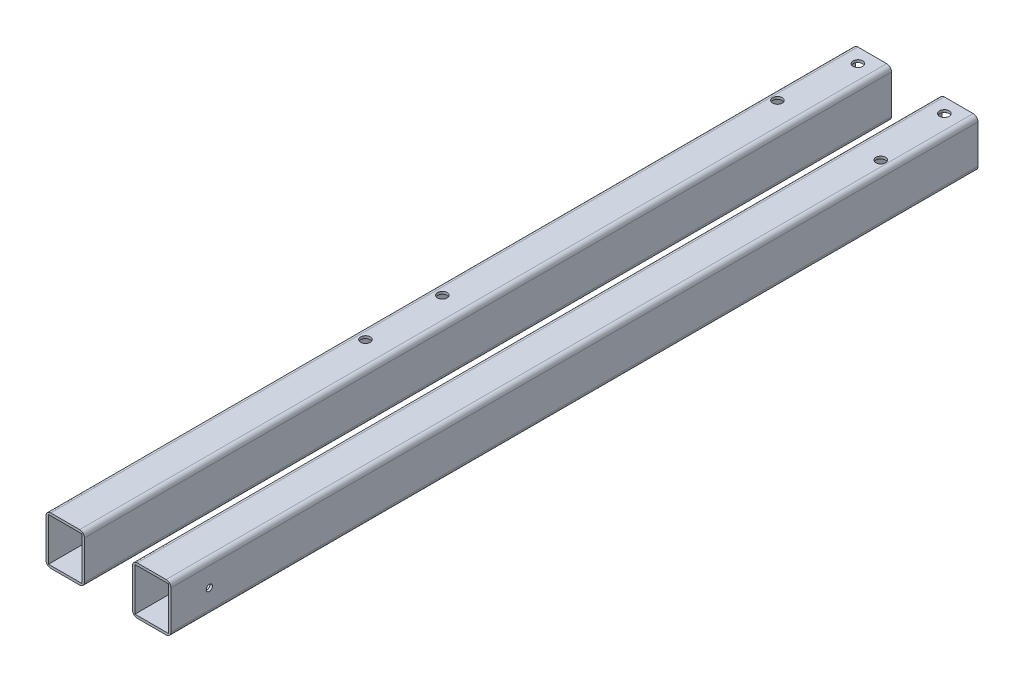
ISO-10303-21;
HEADER;
FILE_DESCRIPTION(('STEP AP214'),'2;1');
FILE_NAME('part.step','',(''),(''),'','','');
FILE_SCHEMA(('AUTOMOTIVE_DESIGN { 1 0 10303 214 1 1 1 1 }'));
ENDSEC;
DATA;
#1=APPLICATION_CONTEXT('core data for automotive mechanical design processes');
#2=APPLICATION_PROTOCOL_DEFINITION('international standard','automotive_design',2000,#1);
#3=PRODUCT_CONTEXT('',#1,'mechanical');
#4=PRODUCT('Part','Part','',(#3));
#5=PRODUCT_RELATED_PRODUCT_CATEGORY('part','',(#4));
#6=PRODUCT_DEFINITION_FORMATION('','',#4);
#7=PRODUCT_DEFINITION_CONTEXT('part definition',#1,'design');
#8=PRODUCT_DEFINITION('design','',#6,#7);
#9=PRODUCT_DEFINITION_SHAPE('','',#8);
#10=(LENGTH_UNIT() NAMED_UNIT(*) SI_UNIT(.MILLI.,.METRE.));
#11=(NAMED_UNIT(*) PLANE_ANGLE_UNIT() SI_UNIT($,.RADIAN.));
#12=(NAMED_UNIT(*) SI_UNIT($,.STERADIAN.) SOLID_ANGLE_UNIT());
#13=UNCERTAINTY_MEASURE_WITH_UNIT(LENGTH_MEASURE(1.E-05),#10,'distance_accuracy_value','');
#14=(GEOMETRIC_REPRESENTATION_CONTEXT(3) GLOBAL_UNCERTAINTY_ASSIGNED_CONTEXT((#13)) GLOBAL_UNIT_ASSIGNED_CONTEXT((#10,
#11,#12)) REPRESENTATION_CONTEXT('',''));
#15=CARTESIAN_POINT('',(0.,0.,0.));
#16=DIRECTION('',(0.,0.,1.));
#17=DIRECTION('',(1.,0.,0.));
#18=AXIS2_PLACEMENT_3D('',#15,#16,#17);
#19=CARTESIAN_POINT('',(41.275,15.875,533.4));
#20=DIRECTION('',(-1.,0.,0.));
#21=DIRECTION('',(0.,-1.,0.));
#22=AXIS2_PLACEMENT_3D('',#19,#20,#21);
#23=PLANE('',#22);
#24=DIRECTION('',(0.,1.,0.));
#25=VECTOR('',#24,1.);
#26=CARTESIAN_POINT('',(41.275,15.875,533.4));
#27=LINE('',#26,#25);
#28=CARTESIAN_POINT('',(41.275,-12.7,533.4));
#29=VERTEX_POINT('',#28);
#30=CARTESIAN_POINT('',(41.275,12.7,533.4));
#31=VERTEX_POINT('',#30);
#32=EDGE_CURVE('E227',#29,#31,#27,.T.);
#33=ORIENTED_EDGE('',*,*,#32,.F.);
#34=DIRECTION('',(0.,0.,-1.));
#35=VECTOR('',#34,1.);
#36=CARTESIAN_POINT('',(41.275,-12.7,533.4));
#37=LINE('',#36,#35);
#38=CARTESIAN_POINT('',(41.275,-12.7,0.));
#39=VERTEX_POINT('',#38);
#40=EDGE_CURVE('E274',#29,#39,#37,.T.);
#41=ORIENTED_EDGE('',*,*,#40,.T.);
#42=DIRECTION('',(0.,1.,0.));
#43=VECTOR('',#42,1.);
#44=CARTESIAN_POINT('',(41.275,15.875,0.));
#45=LINE('',#44,#43);
#46=CARTESIAN_POINT('',(41.275,12.7,0.));
#47=VERTEX_POINT('',#46);
#48=EDGE_CURVE('E201',#39,#47,#45,.T.);
#49=ORIENTED_EDGE('',*,*,#48,.T.);
#50=DIRECTION('',(0.,0.,-1.));
#51=VECTOR('',#50,1.);
#52=CARTESIAN_POINT('',(41.275,12.7,533.4));
#53=LINE('',#52,#51);
#54=EDGE_CURVE('E272',#47,#31,#53,.F.);
#55=ORIENTED_EDGE('',*,*,#54,.T.);
#56=EDGE_LOOP('',(#33,#41,#49,#55));
#57=FACE_BOUND('',#56,.T.);
#58=CARTESIAN_POINT('',(41.275,0.,508.));
#59=DIRECTION('',(-1.,0.,0.));
#60=DIRECTION('',(0.,-1.,0.));
#61=AXIS2_PLACEMENT_3D('',#58,#59,#60);
#62=CIRCLE('',#61,2.05739999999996);
#63=CARTESIAN_POINT('',(41.275,-2.05739999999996,508.));
#64=VERTEX_POINT('',#63);
#65=EDGE_CURVE('E216',#64,#64,#62,.F.);
#66=ORIENTED_EDGE('',*,*,#65,.F.);
#67=EDGE_LOOP('',(#66));
#68=FACE_BOUND('',#67,.T.);
#69=ADVANCED_FACE('F90',(#57,#68),#23,.F.);
#70=CARTESIAN_POINT('',(39.624,15.875,533.4));
#71=DIRECTION('',(-1.,0.,0.));
#72=DIRECTION('',(0.,-1.,0.));
#73=AXIS2_PLACEMENT_3D('',#70,#71,#72);
#74=PLANE('',#73);
#75=DIRECTION('',(0.,1.,0.));
#76=VECTOR('',#75,1.);
#77=CARTESIAN_POINT('',(39.624,15.875,0.));
#78=LINE('',#77,#76);
#79=CARTESIAN_POINT('',(39.624,-14.224,0.));
#80=VERTEX_POINT('',#79);
#81=CARTESIAN_POINT('',(39.624,14.224,0.));
#82=VERTEX_POINT('',#81);
#83=EDGE_CURVE('E214',#80,#82,#78,.T.);
#84=ORIENTED_EDGE('',*,*,#83,.F.);
#85=DIRECTION('',(0.,0.,-1.));
#86=VECTOR('',#85,1.);
#87=CARTESIAN_POINT('',(39.624,-14.224,533.4));
#88=LINE('',#87,#86);
#89=CARTESIAN_POINT('',(39.624,-14.224,533.4));
#90=VERTEX_POINT('',#89);
#91=EDGE_CURVE('E189',#90,#80,#88,.T.);
#92=ORIENTED_EDGE('',*,*,#91,.F.);
#93=DIRECTION('',(0.,1.,0.));
#94=VECTOR('',#93,1.);
#95=CARTESIAN_POINT('',(39.624,15.875,533.4));
#96=LINE('',#95,#94);
#97=CARTESIAN_POINT('',(39.624,14.224,533.4));
#98=VERTEX_POINT('',#97);
#99=EDGE_CURVE('E182',#90,#98,#96,.T.);
#100=ORIENTED_EDGE('',*,*,#99,.T.);
#101=DIRECTION('',(0.,0.,-1.));
#102=VECTOR('',#101,1.);
#103=CARTESIAN_POINT('',(39.624,14.224,533.4));
#104=LINE('',#103,#102);
#105=EDGE_CURVE('E186',#98,#82,#104,.T.);
#106=ORIENTED_EDGE('',*,*,#105,.T.);
#107=EDGE_LOOP('',(#84,#92,#100,#106));
#108=FACE_BOUND('',#107,.T.);
#109=CARTESIAN_POINT('',(39.624,0.,508.));
#110=DIRECTION('',(-1.,0.,0.));
#111=DIRECTION('',(0.,-1.,0.));
#112=AXIS2_PLACEMENT_3D('',#109,#110,#111);
#113=CIRCLE('',#112,2.05739999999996);
#114=CARTESIAN_POINT('',(39.624,-2.05739999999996,508.));
#115=VERTEX_POINT('',#114);
#116=EDGE_CURVE('E279',#115,#115,#113,.F.);
#117=ORIENTED_EDGE('',*,*,#116,.T.);
#118=EDGE_LOOP('',(#117));
#119=FACE_BOUND('',#118,.T.);
#120=ADVANCED_FACE('F184',(#108,#119),#74,.T.);
#121=CARTESIAN_POINT('',(0.,0.,533.4));
#122=DIRECTION('',(0.,0.,1.));
#123=DIRECTION('',(1.,0.,0.));
#124=AXIS2_PLACEMENT_3D('',#121,#122,#123);
#125=PLANE('',#124);
#126=DIRECTION('',(0.,-1.,0.));
#127=VECTOR('',#126,1.);
#128=CARTESIAN_POINT('',(15.875,15.875,533.4));
#129=LINE('',#128,#127);
#130=CARTESIAN_POINT('',(15.875,12.7,533.4));
#131=VERTEX_POINT('',#130);
#132=CARTESIAN_POINT('',(15.875,-12.7,533.4));
#133=VERTEX_POINT('',#132);
#134=EDGE_CURVE('E232',#131,#133,#129,.T.);
#135=ORIENTED_EDGE('',*,*,#134,.T.);
#136=CARTESIAN_POINT('',(19.05,-12.7,533.4));
#137=DIRECTION('',(0.,0.,1.));
#138=DIRECTION('',(1.,0.,0.));
#139=AXIS2_PLACEMENT_3D('',#136,#137,#138);
#140=CIRCLE('',#139,3.175);
#141=CARTESIAN_POINT('',(19.05,-15.875,533.4));
#142=VERTEX_POINT('',#141);
#143=EDGE_CURVE('E270',#133,#142,#140,.T.);
#144=ORIENTED_EDGE('',*,*,#143,.T.);
#145=DIRECTION('',(1.,0.,0.));
#146=VECTOR('',#145,1.);
#147=CARTESIAN_POINT('',(15.875,-15.875,533.4));
#148=LINE('',#147,#146);
#149=CARTESIAN_POINT('',(38.1,-15.875,533.4));
#150=VERTEX_POINT('',#149);
#151=EDGE_CURVE('E235',#142,#150,#148,.T.);
#152=ORIENTED_EDGE('',*,*,#151,.T.);
#153=CARTESIAN_POINT('',(38.1,-12.7,533.4));
#154=DIRECTION('',(0.,0.,1.));
#155=DIRECTION('',(1.,0.,0.));
#156=AXIS2_PLACEMENT_3D('',#153,#154,#155);
#157=CIRCLE('',#156,3.175);
#158=EDGE_CURVE('E268',#150,#29,#157,.T.);
#159=ORIENTED_EDGE('',*,*,#158,.T.);
#160=ORIENTED_EDGE('',*,*,#32,.T.);
#161=CARTESIAN_POINT('',(38.1,12.7,533.4));
#162=DIRECTION('',(0.,0.,1.));
#163=DIRECTION('',(1.,0.,0.));
#164=AXIS2_PLACEMENT_3D('',#161,#162,#163);
#165=CIRCLE('',#164,3.175);
#166=CARTESIAN_POINT('',(38.1,15.875,533.4));
#167=VERTEX_POINT('',#166);
#168=EDGE_CURVE('E112',#31,#167,#165,.T.);
#169=ORIENTED_EDGE('',*,*,#168,.T.);
#170=DIRECTION('',(-1.,0.,0.));
#171=VECTOR('',#170,1.);
#172=CARTESIAN_POINT('',(15.875,15.875,533.4));
#173=LINE('',#172,#171);
#174=CARTESIAN_POINT('',(19.05,15.875,533.4));
#175=VERTEX_POINT('',#174);
#176=EDGE_CURVE('E229',#167,#175,#173,.T.);
#177=ORIENTED_EDGE('',*,*,#176,.T.);
#178=CARTESIAN_POINT('',(19.05,12.7,533.4));
#179=DIRECTION('',(0.,0.,1.));
#180=DIRECTION('',(1.,0.,0.));
#181=AXIS2_PLACEMENT_3D('',#178,#179,#180);
#182=CIRCLE('',#181,3.175);
#183=EDGE_CURVE('E266',#175,#131,#182,.T.);
#184=ORIENTED_EDGE('',*,*,#183,.T.);
#185=EDGE_LOOP('',(#135,#144,#152,#159,#160,#169,#177,#184));
#186=FACE_BOUND('',#185,.T.);
#187=DIRECTION('',(-1.,0.,0.));
#188=VECTOR('',#187,1.);
#189=CARTESIAN_POINT('',(15.875,14.224,533.4));
#190=LINE('',#189,#188);
#191=CARTESIAN_POINT('',(17.526,14.224,533.4));
#192=VERTEX_POINT('',#191);
#193=EDGE_CURVE('E193',#98,#192,#190,.T.);
#194=ORIENTED_EDGE('',*,*,#193,.F.);
#195=ORIENTED_EDGE('',*,*,#99,.F.);
#196=DIRECTION('',(1.,0.,0.));
#197=VECTOR('',#196,1.);
#198=CARTESIAN_POINT('',(15.875,-14.224,533.4));
#199=LINE('',#198,#197);
#200=CARTESIAN_POINT('',(17.526,-14.224,533.4));
#201=VERTEX_POINT('',#200);
#202=EDGE_CURVE('E209',#201,#90,#199,.T.);
#203=ORIENTED_EDGE('',*,*,#202,.F.);
#204=DIRECTION('',(0.,-1.,0.));
#205=VECTOR('',#204,1.);
#206=CARTESIAN_POINT('',(17.526,15.875,533.4));
#207=LINE('',#206,#205);
#208=EDGE_CURVE('E207',#192,#201,#207,.T.);
#209=ORIENTED_EDGE('',*,*,#208,.F.);
#210=EDGE_LOOP('',(#194,#195,#203,#209));
#211=FACE_BOUND('',#210,.T.);
#212=ADVANCED_FACE('F205',(#186,#211),#125,.T.);
#213=CARTESIAN_POINT('',(0.,0.,0.));
#214=DIRECTION('',(0.,0.,1.));
#215=DIRECTION('',(1.,0.,0.));
#216=AXIS2_PLACEMENT_3D('',#213,#214,#215);
#217=PLANE('',#216);
#218=DIRECTION('',(1.,0.,0.));
#219=VECTOR('',#218,1.);
#220=CARTESIAN_POINT('',(15.875,-15.875,0.));
#221=LINE('',#220,#219);
#222=CARTESIAN_POINT('',(19.05,-15.875,0.));
#223=VERTEX_POINT('',#222);
#224=CARTESIAN_POINT('',(38.1,-15.875,0.));
#225=VERTEX_POINT('',#224);
#226=EDGE_CURVE('E230',#223,#225,#221,.T.);
#227=ORIENTED_EDGE('',*,*,#226,.F.);
#228=CARTESIAN_POINT('',(19.05,-12.7,0.));
#229=DIRECTION('',(0.,0.,1.));
#230=DIRECTION('',(1.,0.,0.));
#231=AXIS2_PLACEMENT_3D('',#228,#229,#230);
#232=CIRCLE('',#231,3.175);
#233=CARTESIAN_POINT('',(15.875,-12.7,0.));
#234=VERTEX_POINT('',#233);
#235=EDGE_CURVE('E258',#223,#234,#232,.F.);
#236=ORIENTED_EDGE('',*,*,#235,.T.);
#237=DIRECTION('',(0.,-1.,0.));
#238=VECTOR('',#237,1.);
#239=CARTESIAN_POINT('',(15.875,15.875,0.));
#240=LINE('',#239,#238);
#241=CARTESIAN_POINT('',(15.875,12.7,0.));
#242=VERTEX_POINT('',#241);
#243=EDGE_CURVE('E243',#242,#234,#240,.T.);
#244=ORIENTED_EDGE('',*,*,#243,.F.);
#245=CARTESIAN_POINT('',(19.05,12.7,0.));
#246=DIRECTION('',(0.,0.,1.));
#247=DIRECTION('',(1.,0.,0.));
#248=AXIS2_PLACEMENT_3D('',#245,#246,#247);
#249=CIRCLE('',#248,3.175);
#250=CARTESIAN_POINT('',(19.05,15.875,0.));
#251=VERTEX_POINT('',#250);
#252=EDGE_CURVE('E254',#242,#251,#249,.F.);
#253=ORIENTED_EDGE('',*,*,#252,.T.);
#254=DIRECTION('',(-1.,0.,0.));
#255=VECTOR('',#254,1.);
#256=CARTESIAN_POINT('',(15.875,15.875,0.));
#257=LINE('',#256,#255);
#258=CARTESIAN_POINT('',(38.1,15.875,0.));
#259=VERTEX_POINT('',#258);
#260=EDGE_CURVE('E241',#259,#251,#257,.T.);
#261=ORIENTED_EDGE('',*,*,#260,.F.);
#262=CARTESIAN_POINT('',(38.1,12.7,0.));
#263=DIRECTION('',(0.,0.,1.));
#264=DIRECTION('',(1.,0.,0.));
#265=AXIS2_PLACEMENT_3D('',#262,#263,#264);
#266=CIRCLE('',#265,3.175);
#267=EDGE_CURVE('E252',#259,#47,#266,.F.);
#268=ORIENTED_EDGE('',*,*,#267,.T.);
#269=ORIENTED_EDGE('',*,*,#48,.F.);
#270=CARTESIAN_POINT('',(38.1,-12.7,0.));
#271=DIRECTION('',(0.,0.,1.));
#272=DIRECTION('',(1.,0.,0.));
#273=AXIS2_PLACEMENT_3D('',#270,#271,#272);
#274=CIRCLE('',#273,3.175);
#275=EDGE_CURVE('E256',#39,#225,#274,.F.);
#276=ORIENTED_EDGE('',*,*,#275,.T.);
#277=EDGE_LOOP('',(#227,#236,#244,#253,#261,#268,#269,#276));
#278=FACE_BOUND('',#277,.T.);
#279=ORIENTED_EDGE('',*,*,#83,.T.);
#280=DIRECTION('',(-1.,0.,0.));
#281=VECTOR('',#280,1.);
#282=CARTESIAN_POINT('',(15.875,14.224,0.));
#283=LINE('',#282,#281);
#284=CARTESIAN_POINT('',(17.526,14.224,0.));
#285=VERTEX_POINT('',#284);
#286=EDGE_CURVE('E200',#82,#285,#283,.T.);
#287=ORIENTED_EDGE('',*,*,#286,.T.);
#288=DIRECTION('',(0.,-1.,0.));
#289=VECTOR('',#288,1.);
#290=CARTESIAN_POINT('',(17.526,15.875,0.));
#291=LINE('',#290,#289);
#292=CARTESIAN_POINT('',(17.526,-14.224,0.));
#293=VERTEX_POINT('',#292);
#294=EDGE_CURVE('E218',#285,#293,#291,.T.);
#295=ORIENTED_EDGE('',*,*,#294,.T.);
#296=DIRECTION('',(1.,0.,0.));
#297=VECTOR('',#296,1.);
#298=CARTESIAN_POINT('',(15.875,-14.224,0.));
#299=LINE('',#298,#297);
#300=EDGE_CURVE('E194',#293,#80,#299,.T.);
#301=ORIENTED_EDGE('',*,*,#300,.T.);
#302=EDGE_LOOP('',(#279,#287,#295,#301));
#303=FACE_BOUND('',#302,.T.);
#304=ADVANCED_FACE('F358',(#278,#303),#217,.F.);
#305=CARTESIAN_POINT('',(15.875,15.875,533.4));
#306=DIRECTION('',(0.,-1.,0.));
#307=DIRECTION('',(1.,0.,0.));
#308=AXIS2_PLACEMENT_3D('',#305,#306,#307);
#309=PLANE('',#308);
#310=CARTESIAN_POINT('',(28.575,15.875,9.525));
#311=DIRECTION('',(0.,-1.,0.));
#312=DIRECTION('',(1.,0.,0.));
#313=AXIS2_PLACEMENT_3D('',#310,#311,#312);
#314=CIRCLE('',#313,3.175);
#315=CARTESIAN_POINT('',(31.75,15.875,9.525));
#316=VERTEX_POINT('',#315);
#317=EDGE_CURVE('E281',#316,#316,#314,.T.);
#318=ORIENTED_EDGE('',*,*,#317,.T.);
#319=EDGE_LOOP('',(#318));
#320=FACE_BOUND('',#319,.T.);
#321=CARTESIAN_POINT('',(34.1376,15.875,57.15));
#322=DIRECTION('',(0.,-1.,0.));
#323=DIRECTION('',(1.,0.,0.));
#324=AXIS2_PLACEMENT_3D('',#321,#322,#323);
#325=CIRCLE('',#324,3.175);
#326=CARTESIAN_POINT('',(37.3126,15.875,57.15));
#327=VERTEX_POINT('',#326);
#328=EDGE_CURVE('E293',#327,#327,#325,.T.);
#329=ORIENTED_EDGE('',*,*,#328,.T.);
#330=EDGE_LOOP('',(#329));
#331=FACE_BOUND('',#330,.T.);
#332=ORIENTED_EDGE('',*,*,#260,.T.);
#333=DIRECTION('',(0.,0.,-1.));
#334=VECTOR('',#333,1.);
#335=CARTESIAN_POINT('',(19.05,15.875,533.4));
#336=LINE('',#335,#334);
#337=EDGE_CURVE('E13',#251,#175,#336,.F.);
#338=ORIENTED_EDGE('',*,*,#337,.T.);
#339=ORIENTED_EDGE('',*,*,#176,.F.);
#340=DIRECTION('',(0.,0.,-1.));
#341=VECTOR('',#340,1.);
#342=CARTESIAN_POINT('',(38.1,15.875,533.4));
#343=LINE('',#342,#341);
#344=EDGE_CURVE('E99',#167,#259,#343,.T.);
#345=ORIENTED_EDGE('',*,*,#344,.T.);
#346=EDGE_LOOP('',(#332,#338,#339,#345));
#347=FACE_BOUND('',#346,.T.);
#348=ADVANCED_FACE('F320',(#320,#331,#347),#309,.F.);
#349=CARTESIAN_POINT('',(15.875,15.875,533.4));
#350=DIRECTION('',(1.,0.,0.));
#351=DIRECTION('',(0.,1.,0.));
#352=AXIS2_PLACEMENT_3D('',#349,#350,#351);
#353=PLANE('',#352);
#354=ORIENTED_EDGE('',*,*,#243,.T.);
#355=DIRECTION('',(0.,0.,-1.));
#356=VECTOR('',#355,1.);
#357=CARTESIAN_POINT('',(15.875,-12.7,533.4));
#358=LINE('',#357,#356);
#359=EDGE_CURVE('E263',#234,#133,#358,.F.);
#360=ORIENTED_EDGE('',*,*,#359,.T.);
#361=ORIENTED_EDGE('',*,*,#134,.F.);
#362=DIRECTION('',(0.,0.,-1.));
#363=VECTOR('',#362,1.);
#364=CARTESIAN_POINT('',(15.875,12.7,533.4));
#365=LINE('',#364,#363);
#366=EDGE_CURVE('E260',#131,#242,#365,.T.);
#367=ORIENTED_EDGE('',*,*,#366,.T.);
#368=EDGE_LOOP('',(#354,#360,#361,#367));
#369=FACE_BOUND('',#368,.T.);
#370=ADVANCED_FACE('F342',(#369),#353,.F.);
#371=CARTESIAN_POINT('',(15.875,-15.875,533.4));
#372=DIRECTION('',(0.,1.,0.));
#373=DIRECTION('',(-1.,0.,0.));
#374=AXIS2_PLACEMENT_3D('',#371,#372,#373);
#375=PLANE('',#374);
#376=CARTESIAN_POINT('',(28.575,-15.875,9.525));
#377=DIRECTION('',(0.,1.,0.));
#378=DIRECTION('',(-1.,0.,0.));
#379=AXIS2_PLACEMENT_3D('',#376,#377,#378);
#380=CIRCLE('',#379,3.175);
#381=CARTESIAN_POINT('',(25.4,-15.875,9.525));
#382=VERTEX_POINT('',#381);
#383=EDGE_CURVE('E301',#382,#382,#380,.T.);
#384=ORIENTED_EDGE('',*,*,#383,.T.);
#385=EDGE_LOOP('',(#384));
#386=FACE_BOUND('',#385,.T.);
#387=CARTESIAN_POINT('',(34.1376,-15.875,57.15));
#388=DIRECTION('',(0.,1.,0.));
#389=DIRECTION('',(-1.,0.,0.));
#390=AXIS2_PLACEMENT_3D('',#387,#388,#389);
#391=CIRCLE('',#390,3.175);
#392=CARTESIAN_POINT('',(30.9626,-15.875,57.15));
#393=VERTEX_POINT('',#392);
#394=EDGE_CURVE('E288',#393,#393,#391,.T.);
#395=ORIENTED_EDGE('',*,*,#394,.T.);
#396=EDGE_LOOP('',(#395));
#397=FACE_BOUND('',#396,.T.);
#398=ORIENTED_EDGE('',*,*,#151,.F.);
#399=DIRECTION('',(0.,0.,-1.));
#400=VECTOR('',#399,1.);
#401=CARTESIAN_POINT('',(19.05,-15.875,533.4));
#402=LINE('',#401,#400);
#403=EDGE_CURVE('E249',#142,#223,#402,.T.);
#404=ORIENTED_EDGE('',*,*,#403,.T.);
#405=ORIENTED_EDGE('',*,*,#226,.T.);
#406=DIRECTION('',(0.,0.,-1.));
#407=VECTOR('',#406,1.);
#408=CARTESIAN_POINT('',(38.1,-15.875,533.4));
#409=LINE('',#408,#407);
#410=EDGE_CURVE('E238',#225,#150,#409,.F.);
#411=ORIENTED_EDGE('',*,*,#410,.T.);
#412=EDGE_LOOP('',(#398,#404,#405,#411));
#413=FACE_BOUND('',#412,.T.);
#414=ADVANCED_FACE('F349',(#386,#397,#413),#375,.F.);
#415=CARTESIAN_POINT('',(15.875,14.224,533.4));
#416=DIRECTION('',(0.,-1.,0.));
#417=DIRECTION('',(1.,0.,0.));
#418=AXIS2_PLACEMENT_3D('',#415,#416,#417);
#419=PLANE('',#418);
#420=CARTESIAN_POINT('',(28.575,14.224,9.525));
#421=DIRECTION('',(0.,-1.,0.));
#422=DIRECTION('',(1.,0.,0.));
#423=AXIS2_PLACEMENT_3D('',#420,#421,#422);
#424=CIRCLE('',#423,3.175);
#425=CARTESIAN_POINT('',(31.75,14.224,9.525));
#426=VERTEX_POINT('',#425);
#427=EDGE_CURVE('E298',#426,#426,#424,.T.);
#428=ORIENTED_EDGE('',*,*,#427,.F.);
#429=EDGE_LOOP('',(#428));
#430=FACE_BOUND('',#429,.T.);
#431=CARTESIAN_POINT('',(34.1376,14.224,57.15));
#432=DIRECTION('',(0.,-1.,0.));
#433=DIRECTION('',(1.,0.,0.));
#434=AXIS2_PLACEMENT_3D('',#431,#432,#433);
#435=CIRCLE('',#434,3.175);
#436=CARTESIAN_POINT('',(37.3126,14.224,57.15));
#437=VERTEX_POINT('',#436);
#438=EDGE_CURVE('E284',#437,#437,#435,.T.);
#439=ORIENTED_EDGE('',*,*,#438,.F.);
#440=EDGE_LOOP('',(#439));
#441=FACE_BOUND('',#440,.T.);
#442=ORIENTED_EDGE('',*,*,#286,.F.);
#443=ORIENTED_EDGE('',*,*,#105,.F.);
#444=ORIENTED_EDGE('',*,*,#193,.T.);
#445=DIRECTION('',(0.,0.,-1.));
#446=VECTOR('',#445,1.);
#447=CARTESIAN_POINT('',(17.526,14.224,533.4));
#448=LINE('',#447,#446);
#449=EDGE_CURVE('E202',#192,#285,#448,.T.);
#450=ORIENTED_EDGE('',*,*,#449,.T.);
#451=EDGE_LOOP('',(#442,#443,#444,#450));
#452=FACE_BOUND('',#451,.T.);
#453=ADVANCED_FACE('F197',(#430,#441,#452),#419,.T.);
#454=CARTESIAN_POINT('',(17.526,15.875,533.4));
#455=DIRECTION('',(1.,0.,0.));
#456=DIRECTION('',(0.,1.,0.));
#457=AXIS2_PLACEMENT_3D('',#454,#455,#456);
#458=PLANE('',#457);
#459=ORIENTED_EDGE('',*,*,#294,.F.);
#460=ORIENTED_EDGE('',*,*,#449,.F.);
#461=ORIENTED_EDGE('',*,*,#208,.T.);
#462=DIRECTION('',(0.,0.,-1.));
#463=VECTOR('',#462,1.);
#464=CARTESIAN_POINT('',(17.526,-14.224,533.4));
#465=LINE('',#464,#463);
#466=EDGE_CURVE('E224',#201,#293,#465,.T.);
#467=ORIENTED_EDGE('',*,*,#466,.T.);
#468=EDGE_LOOP('',(#459,#460,#461,#467));
#469=FACE_BOUND('',#468,.T.);
#470=ADVANCED_FACE('F366',(#469),#458,.T.);
#471=CARTESIAN_POINT('',(15.875,-14.224,533.4));
#472=DIRECTION('',(0.,1.,0.));
#473=DIRECTION('',(-1.,0.,0.));
#474=AXIS2_PLACEMENT_3D('',#471,#472,#473);
#475=PLANE('',#474);
#476=CARTESIAN_POINT('',(28.575,-14.224,9.525));
#477=DIRECTION('',(0.,1.,0.));
#478=DIRECTION('',(-1.,0.,0.));
#479=AXIS2_PLACEMENT_3D('',#476,#477,#478);
#480=CIRCLE('',#479,3.175);
#481=CARTESIAN_POINT('',(25.4,-14.224,9.525));
#482=VERTEX_POINT('',#481);
#483=EDGE_CURVE('E94',#482,#482,#480,.T.);
#484=ORIENTED_EDGE('',*,*,#483,.F.);
#485=EDGE_LOOP('',(#484));
#486=FACE_BOUND('',#485,.T.);
#487=CARTESIAN_POINT('',(34.1376,-14.224,57.15));
#488=DIRECTION('',(0.,1.,0.));
#489=DIRECTION('',(-1.,0.,0.));
#490=AXIS2_PLACEMENT_3D('',#487,#488,#489);
#491=CIRCLE('',#490,3.175);
#492=CARTESIAN_POINT('',(30.9626,-14.224,57.15));
#493=VERTEX_POINT('',#492);
#494=EDGE_CURVE('E282',#493,#493,#491,.T.);
#495=ORIENTED_EDGE('',*,*,#494,.F.);
#496=EDGE_LOOP('',(#495));
#497=FACE_BOUND('',#496,.T.);
#498=ORIENTED_EDGE('',*,*,#300,.F.);
#499=ORIENTED_EDGE('',*,*,#466,.F.);
#500=ORIENTED_EDGE('',*,*,#202,.T.);
#501=ORIENTED_EDGE('',*,*,#91,.T.);
#502=EDGE_LOOP('',(#498,#499,#500,#501));
#503=FACE_BOUND('',#502,.T.);
#504=ADVANCED_FACE('F326',(#486,#497,#503),#475,.T.);
#505=CARTESIAN_POINT('',(19.05,-12.7,533.4));
#506=DIRECTION('',(0.,0.,-1.));
#507=DIRECTION('',(-1.,0.,0.));
#508=AXIS2_PLACEMENT_3D('',#505,#506,#507);
#509=CYLINDRICAL_SURFACE('',#508,3.175);
#510=ORIENTED_EDGE('',*,*,#143,.F.);
#511=ORIENTED_EDGE('',*,*,#359,.F.);
#512=ORIENTED_EDGE('',*,*,#235,.F.);
#513=ORIENTED_EDGE('',*,*,#403,.F.);
#514=EDGE_LOOP('',(#510,#511,#512,#513));
#515=FACE_BOUND('',#514,.T.);
#516=ADVANCED_FACE('F322',(#515),#509,.T.);
#517=CARTESIAN_POINT('',(38.1,-12.7,533.4));
#518=DIRECTION('',(0.,0.,-1.));
#519=DIRECTION('',(-1.,0.,0.));
#520=AXIS2_PLACEMENT_3D('',#517,#518,#519);
#521=CYLINDRICAL_SURFACE('',#520,3.175);
#522=ORIENTED_EDGE('',*,*,#158,.F.);
#523=ORIENTED_EDGE('',*,*,#410,.F.);
#524=ORIENTED_EDGE('',*,*,#275,.F.);
#525=ORIENTED_EDGE('',*,*,#40,.F.);
#526=EDGE_LOOP('',(#522,#523,#524,#525));
#527=FACE_BOUND('',#526,.T.);
#528=ADVANCED_FACE('F325',(#527),#521,.T.);
#529=CARTESIAN_POINT('',(19.05,12.7,533.4));
#530=DIRECTION('',(0.,0.,-1.));
#531=DIRECTION('',(-1.,0.,0.));
#532=AXIS2_PLACEMENT_3D('',#529,#530,#531);
#533=CYLINDRICAL_SURFACE('',#532,3.175);
#534=ORIENTED_EDGE('',*,*,#183,.F.);
#535=ORIENTED_EDGE('',*,*,#337,.F.);
#536=ORIENTED_EDGE('',*,*,#252,.F.);
#537=ORIENTED_EDGE('',*,*,#366,.F.);
#538=EDGE_LOOP('',(#534,#535,#536,#537));
#539=FACE_BOUND('',#538,.T.);
#540=ADVANCED_FACE('F329',(#539),#533,.T.);
#541=CARTESIAN_POINT('',(38.1,12.7,533.4));
#542=DIRECTION('',(0.,0.,-1.));
#543=DIRECTION('',(-1.,0.,0.));
#544=AXIS2_PLACEMENT_3D('',#541,#542,#543);
#545=CYLINDRICAL_SURFACE('',#544,3.175);
#546=ORIENTED_EDGE('',*,*,#168,.F.);
#547=ORIENTED_EDGE('',*,*,#54,.F.);
#548=ORIENTED_EDGE('',*,*,#267,.F.);
#549=ORIENTED_EDGE('',*,*,#344,.F.);
#550=EDGE_LOOP('',(#546,#547,#548,#549));
#551=FACE_BOUND('',#550,.T.);
#552=ADVANCED_FACE('F92',(#551),#545,.T.);
#553=CARTESIAN_POINT('',(50.8,0.,508.));
#554=DIRECTION('',(-1.,0.,0.));
#555=DIRECTION('',(0.,0.,1.));
#556=AXIS2_PLACEMENT_3D('',#553,#554,#555);
#557=CYLINDRICAL_SURFACE('',#556,2.05739999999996);
#558=ORIENTED_EDGE('',*,*,#116,.F.);
#559=EDGE_LOOP('',(#558));
#560=FACE_BOUND('',#559,.T.);
#561=ORIENTED_EDGE('',*,*,#65,.T.);
#562=EDGE_LOOP('',(#561));
#563=FACE_BOUND('',#562,.T.);
#564=ADVANCED_FACE('F308',(#560,#563),#557,.F.);
#565=CARTESIAN_POINT('',(34.1376,-25.4,57.15));
#566=DIRECTION('',(0.,1.,0.));
#567=DIRECTION('',(0.,0.,1.));
#568=AXIS2_PLACEMENT_3D('',#565,#566,#567);
#569=CYLINDRICAL_SURFACE('',#568,3.175);
#570=ORIENTED_EDGE('',*,*,#494,.T.);
#571=EDGE_LOOP('',(#570));
#572=FACE_BOUND('',#571,.T.);
#573=ORIENTED_EDGE('',*,*,#394,.F.);
#574=EDGE_LOOP('',(#573));
#575=FACE_BOUND('',#574,.T.);
#576=ADVANCED_FACE('F399',(#572,#575),#569,.F.);
#577=CARTESIAN_POINT('',(28.575,-25.4,9.525));
#578=DIRECTION('',(0.,1.,0.));
#579=DIRECTION('',(0.,0.,1.));
#580=AXIS2_PLACEMENT_3D('',#577,#578,#579);
#581=CYLINDRICAL_SURFACE('',#580,3.175);
#582=ORIENTED_EDGE('',*,*,#483,.T.);
#583=EDGE_LOOP('',(#582));
#584=FACE_BOUND('',#583,.T.);
#585=ORIENTED_EDGE('',*,*,#383,.F.);
#586=EDGE_LOOP('',(#585));
#587=FACE_BOUND('',#586,.T.);
#588=ADVANCED_FACE('F397',(#584,#587),#581,.F.);
#589=ORIENTED_EDGE('',*,*,#438,.T.);
#590=EDGE_LOOP('',(#589));
#591=FACE_BOUND('',#590,.T.);
#592=ORIENTED_EDGE('',*,*,#328,.F.);
#593=EDGE_LOOP('',(#592));
#594=FACE_BOUND('',#593,.T.);
#595=ADVANCED_FACE('F394',(#591,#594),#569,.F.);
#596=ORIENTED_EDGE('',*,*,#427,.T.);
#597=EDGE_LOOP('',(#596));
#598=FACE_BOUND('',#597,.T.);
#599=ORIENTED_EDGE('',*,*,#317,.F.);
#600=EDGE_LOOP('',(#599));
#601=FACE_BOUND('',#600,.T.);
#602=ADVANCED_FACE('F396',(#598,#601),#581,.F.);
#603=CLOSED_SHELL('',(#69,#120,#212,#304,#348,#370,#414,#453,#470,#504,#516,#528,#540,#552,#564,
#576,#588,#595,#602));
#604=MANIFOLD_SOLID_BREP('B2',#603);
#605=CARTESIAN_POINT('',(0.,0.,533.4));
#606=DIRECTION('',(0.,0.,1.));
#607=DIRECTION('',(1.,0.,0.));
#608=AXIS2_PLACEMENT_3D('',#605,#606,#607);
#609=PLANE('',#608);
#610=DIRECTION('',(-1.,0.,0.));
#611=VECTOR('',#610,1.);
#612=CARTESIAN_POINT('',(-41.275,15.875,533.4));
#613=LINE('',#612,#611);
#614=CARTESIAN_POINT('',(-19.05,15.875,533.4));
#615=VERTEX_POINT('',#614);
#616=CARTESIAN_POINT('',(-38.1,15.875,533.4));
#617=VERTEX_POINT('',#616);
#618=EDGE_CURVE('E667',#615,#617,#613,.T.);
#619=ORIENTED_EDGE('',*,*,#618,.T.);
#620=CARTESIAN_POINT('',(-38.1,12.7,533.4));
#621=DIRECTION('',(0.,0.,1.));
#622=DIRECTION('',(1.,0.,0.));
#623=AXIS2_PLACEMENT_3D('',#620,#621,#622);
#624=CIRCLE('',#623,3.175);
#625=CARTESIAN_POINT('',(-41.275,12.7,533.4));
#626=VERTEX_POINT('',#625);
#627=EDGE_CURVE('E707',#617,#626,#624,.T.);
#628=ORIENTED_EDGE('',*,*,#627,.T.);
#629=DIRECTION('',(0.,-1.,0.));
#630=VECTOR('',#629,1.);
#631=CARTESIAN_POINT('',(-41.275,15.875,533.4));
#632=LINE('',#631,#630);
#633=CARTESIAN_POINT('',(-41.275,-12.7,533.4));
#634=VERTEX_POINT('',#633);
#635=EDGE_CURVE('E671',#626,#634,#632,.T.);
#636=ORIENTED_EDGE('',*,*,#635,.T.);
#637=CARTESIAN_POINT('',(-38.1,-12.7,533.4));
#638=DIRECTION('',(0.,0.,1.));
#639=DIRECTION('',(1.,0.,0.));
#640=AXIS2_PLACEMENT_3D('',#637,#638,#639);
#641=CIRCLE('',#640,3.175);
#642=CARTESIAN_POINT('',(-38.1,-15.875,533.4));
#643=VERTEX_POINT('',#642);
#644=EDGE_CURVE('E551',#634,#643,#641,.T.);
#645=ORIENTED_EDGE('',*,*,#644,.T.);
#646=DIRECTION('',(1.,0.,0.));
#647=VECTOR('',#646,1.);
#648=CARTESIAN_POINT('',(-41.275,-15.875,533.4));
#649=LINE('',#648,#647);
#650=CARTESIAN_POINT('',(-19.05,-15.875,533.4));
#651=VERTEX_POINT('',#650);
#652=EDGE_CURVE('E673',#643,#651,#649,.T.);
#653=ORIENTED_EDGE('',*,*,#652,.T.);
#654=CARTESIAN_POINT('',(-19.05,-12.7,533.4));
#655=DIRECTION('',(0.,0.,1.));
#656=DIRECTION('',(1.,0.,0.));
#657=AXIS2_PLACEMENT_3D('',#654,#655,#656);
#658=CIRCLE('',#657,3.175);
#659=CARTESIAN_POINT('',(-15.875,-12.7,533.4));
#660=VERTEX_POINT('',#659);
#661=EDGE_CURVE('E704',#651,#660,#658,.T.);
#662=ORIENTED_EDGE('',*,*,#661,.T.);
#663=DIRECTION('',(0.,1.,0.));
#664=VECTOR('',#663,1.);
#665=CARTESIAN_POINT('',(-15.875,15.875,533.4));
#666=LINE('',#665,#664);
#667=CARTESIAN_POINT('',(-15.875,12.7,533.4));
#668=VERTEX_POINT('',#667);
#669=EDGE_CURVE('E664',#660,#668,#666,.T.);
#670=ORIENTED_EDGE('',*,*,#669,.T.);
#671=CARTESIAN_POINT('',(-19.05,12.7,533.4));
#672=DIRECTION('',(0.,0.,1.));
#673=DIRECTION('',(1.,0.,0.));
#674=AXIS2_PLACEMENT_3D('',#671,#672,#673);
#675=CIRCLE('',#674,3.175);
#676=EDGE_CURVE('E702',#668,#615,#675,.T.);
#677=ORIENTED_EDGE('',*,*,#676,.T.);
#678=EDGE_LOOP('',(#619,#628,#636,#645,#653,#662,#670,#677));
#679=FACE_BOUND('',#678,.T.);
#680=DIRECTION('',(-1.,0.,0.));
#681=VECTOR('',#680,1.);
#682=CARTESIAN_POINT('',(-41.275,14.224,533.4));
#683=LINE('',#682,#681);
#684=CARTESIAN_POINT('',(-17.526,14.224,533.4));
#685=VERTEX_POINT('',#684);
#686=CARTESIAN_POINT('',(-39.624,14.224,533.4));
#687=VERTEX_POINT('',#686);
#688=EDGE_CURVE('E631',#685,#687,#683,.T.);
#689=ORIENTED_EDGE('',*,*,#688,.F.);
#690=DIRECTION('',(0.,1.,0.));
#691=VECTOR('',#690,1.);
#692=CARTESIAN_POINT('',(-17.526,15.875,533.4));
#693=LINE('',#692,#691);
#694=CARTESIAN_POINT('',(-17.526,-14.224,533.4));
#695=VERTEX_POINT('',#694);
#696=EDGE_CURVE('E621',#695,#685,#693,.T.);
#697=ORIENTED_EDGE('',*,*,#696,.F.);
#698=DIRECTION('',(1.,0.,0.));
#699=VECTOR('',#698,1.);
#700=CARTESIAN_POINT('',(-41.275,-14.224,533.4));
#701=LINE('',#700,#699);
#702=CARTESIAN_POINT('',(-39.624,-14.224,533.4));
#703=VERTEX_POINT('',#702);
#704=EDGE_CURVE('E646',#703,#695,#701,.T.);
#705=ORIENTED_EDGE('',*,*,#704,.F.);
#706=DIRECTION('',(0.,-1.,0.));
#707=VECTOR('',#706,1.);
#708=CARTESIAN_POINT('',(-39.624,15.875,533.4));
#709=LINE('',#708,#707);
#710=EDGE_CURVE('E644',#687,#703,#709,.T.);
#711=ORIENTED_EDGE('',*,*,#710,.F.);
#712=EDGE_LOOP('',(#689,#697,#705,#711));
#713=FACE_BOUND('',#712,.T.);
#714=ADVANCED_FACE('F527',(#679,#713),#609,.T.);
#715=CARTESIAN_POINT('',(0.,0.,0.));
#716=DIRECTION('',(0.,0.,1.));
#717=DIRECTION('',(1.,0.,0.));
#718=AXIS2_PLACEMENT_3D('',#715,#716,#717);
#719=PLANE('',#718);
#720=DIRECTION('',(0.,-1.,0.));
#721=VECTOR('',#720,1.);
#722=CARTESIAN_POINT('',(-41.275,15.875,0.));
#723=LINE('',#722,#721);
#724=CARTESIAN_POINT('',(-41.275,12.7,0.));
#725=VERTEX_POINT('',#724);
#726=CARTESIAN_POINT('',(-41.275,-12.7,0.));
#727=VERTEX_POINT('',#726);
#728=EDGE_CURVE('E681',#725,#727,#723,.T.);
#729=ORIENTED_EDGE('',*,*,#728,.F.);
#730=CARTESIAN_POINT('',(-38.1,12.7,0.));
#731=DIRECTION('',(0.,0.,1.));
#732=DIRECTION('',(1.,0.,0.));
#733=AXIS2_PLACEMENT_3D('',#730,#731,#732);
#734=CIRCLE('',#733,3.175);
#735=CARTESIAN_POINT('',(-38.1,15.875,0.));
#736=VERTEX_POINT('',#735);
#737=EDGE_CURVE('E695',#725,#736,#734,.F.);
#738=ORIENTED_EDGE('',*,*,#737,.T.);
#739=DIRECTION('',(-1.,0.,0.));
#740=VECTOR('',#739,1.);
#741=CARTESIAN_POINT('',(-41.275,15.875,0.));
#742=LINE('',#741,#740);
#743=CARTESIAN_POINT('',(-19.05,15.875,0.));
#744=VERTEX_POINT('',#743);
#745=EDGE_CURVE('E678',#744,#736,#742,.T.);
#746=ORIENTED_EDGE('',*,*,#745,.F.);
#747=CARTESIAN_POINT('',(-19.05,12.7,0.));
#748=DIRECTION('',(0.,0.,1.));
#749=DIRECTION('',(1.,0.,0.));
#750=AXIS2_PLACEMENT_3D('',#747,#748,#749);
#751=CIRCLE('',#750,3.175);
#752=CARTESIAN_POINT('',(-15.875,12.7,0.));
#753=VERTEX_POINT('',#752);
#754=EDGE_CURVE('E689',#744,#753,#751,.F.);
#755=ORIENTED_EDGE('',*,*,#754,.T.);
#756=DIRECTION('',(0.,1.,0.));
#757=VECTOR('',#756,1.);
#758=CARTESIAN_POINT('',(-15.875,15.875,0.));
#759=LINE('',#758,#757);
#760=CARTESIAN_POINT('',(-15.875,-12.7,0.));
#761=VERTEX_POINT('',#760);
#762=EDGE_CURVE('E639',#761,#753,#759,.T.);
#763=ORIENTED_EDGE('',*,*,#762,.F.);
#764=CARTESIAN_POINT('',(-19.05,-12.7,0.));
#765=DIRECTION('',(0.,0.,1.));
#766=DIRECTION('',(1.,0.,0.));
#767=AXIS2_PLACEMENT_3D('',#764,#765,#766);
#768=CIRCLE('',#767,3.175);
#769=CARTESIAN_POINT('',(-19.05,-15.875,0.));
#770=VERTEX_POINT('',#769);
#771=EDGE_CURVE('E691',#761,#770,#768,.F.);
#772=ORIENTED_EDGE('',*,*,#771,.T.);
#773=DIRECTION('',(1.,0.,0.));
#774=VECTOR('',#773,1.);
#775=CARTESIAN_POINT('',(-41.275,-15.875,0.));
#776=LINE('',#775,#774);
#777=CARTESIAN_POINT('',(-38.1,-15.875,0.));
#778=VERTEX_POINT('',#777);
#779=EDGE_CURVE('E668',#778,#770,#776,.T.);
#780=ORIENTED_EDGE('',*,*,#779,.F.);
#781=CARTESIAN_POINT('',(-38.1,-12.7,0.));
#782=DIRECTION('',(0.,0.,1.));
#783=DIRECTION('',(1.,0.,0.));
#784=AXIS2_PLACEMENT_3D('',#781,#782,#783);
#785=CIRCLE('',#784,3.175);
#786=EDGE_CURVE('E693',#778,#727,#785,.F.);
#787=ORIENTED_EDGE('',*,*,#786,.T.);
#788=EDGE_LOOP('',(#729,#738,#746,#755,#763,#772,#780,#787));
#789=FACE_BOUND('',#788,.T.);
#790=DIRECTION('',(0.,1.,0.));
#791=VECTOR('',#790,1.);
#792=CARTESIAN_POINT('',(-17.526,15.875,0.));
#793=LINE('',#792,#791);
#794=CARTESIAN_POINT('',(-17.526,-14.224,0.));
#795=VERTEX_POINT('',#794);
#796=CARTESIAN_POINT('',(-17.526,14.224,0.));
#797=VERTEX_POINT('',#796);
#798=EDGE_CURVE('E651',#795,#797,#793,.T.);
#799=ORIENTED_EDGE('',*,*,#798,.T.);
#800=DIRECTION('',(-1.,0.,0.));
#801=VECTOR('',#800,1.);
#802=CARTESIAN_POINT('',(-41.275,14.224,0.));
#803=LINE('',#802,#801);
#804=CARTESIAN_POINT('',(-39.624,14.224,0.));
#805=VERTEX_POINT('',#804);
#806=EDGE_CURVE('E638',#797,#805,#803,.T.);
#807=ORIENTED_EDGE('',*,*,#806,.T.);
#808=DIRECTION('',(0.,-1.,0.));
#809=VECTOR('',#808,1.);
#810=CARTESIAN_POINT('',(-39.624,15.875,0.));
#811=LINE('',#810,#809);
#812=CARTESIAN_POINT('',(-39.624,-14.224,0.));
#813=VERTEX_POINT('',#812);
#814=EDGE_CURVE('E655',#805,#813,#811,.T.);
#815=ORIENTED_EDGE('',*,*,#814,.T.);
#816=DIRECTION('',(1.,0.,0.));
#817=VECTOR('',#816,1.);
#818=CARTESIAN_POINT('',(-41.275,-14.224,0.));
#819=LINE('',#818,#817);
#820=EDGE_CURVE('E632',#813,#795,#819,.T.);
#821=ORIENTED_EDGE('',*,*,#820,.T.);
#822=EDGE_LOOP('',(#799,#807,#815,#821));
#823=FACE_BOUND('',#822,.T.);
#824=ADVANCED_FACE('F782',(#789,#823),#719,.F.);
#825=CARTESIAN_POINT('',(-15.875,15.875,533.4));
#826=DIRECTION('',(-1.,0.,0.));
#827=DIRECTION('',(0.,-1.,0.));
#828=AXIS2_PLACEMENT_3D('',#825,#826,#827);
#829=PLANE('',#828);
#830=ORIENTED_EDGE('',*,*,#669,.F.);
#831=DIRECTION('',(0.,0.,-1.));
#832=VECTOR('',#831,1.);
#833=CARTESIAN_POINT('',(-15.875,-12.7,533.4));
#834=LINE('',#833,#832);
#835=EDGE_CURVE('E88',#660,#761,#834,.T.);
#836=ORIENTED_EDGE('',*,*,#835,.T.);
#837=ORIENTED_EDGE('',*,*,#762,.T.);
#838=DIRECTION('',(0.,0.,-1.));
#839=VECTOR('',#838,1.);
#840=CARTESIAN_POINT('',(-15.875,12.7,533.4));
#841=LINE('',#840,#839);
#842=EDGE_CURVE('E536',#753,#668,#841,.F.);
#843=ORIENTED_EDGE('',*,*,#842,.T.);
#844=EDGE_LOOP('',(#830,#836,#837,#843));
#845=FACE_BOUND('',#844,.T.);
#846=ADVANCED_FACE('F787',(#845),#829,.F.);
#847=CARTESIAN_POINT('',(-41.275,15.875,533.4));
#848=DIRECTION('',(0.,-1.,0.));
#849=DIRECTION('',(1.,0.,0.));
#850=AXIS2_PLACEMENT_3D('',#847,#848,#849);
#851=PLANE('',#850);
#852=CARTESIAN_POINT('',(-33.3248,15.875,279.4));
#853=DIRECTION('',(0.,-1.,0.));
#854=DIRECTION('',(1.,0.,0.));
#855=AXIS2_PLACEMENT_3D('',#852,#853,#854);
#856=CIRCLE('',#855,3.175);
#857=CARTESIAN_POINT('',(-30.1498,15.875,279.4));
#858=VERTEX_POINT('',#857);
#859=EDGE_CURVE('E726',#858,#858,#856,.T.);
#860=ORIENTED_EDGE('',*,*,#859,.T.);
#861=EDGE_LOOP('',(#860));
#862=FACE_BOUND('',#861,.T.);
#863=CARTESIAN_POINT('',(-33.3248,15.875,330.2));
#864=DIRECTION('',(0.,-1.,0.));
#865=DIRECTION('',(1.,0.,0.));
#866=AXIS2_PLACEMENT_3D('',#863,#864,#865);
#867=CIRCLE('',#866,3.175);
#868=CARTESIAN_POINT('',(-30.1498,15.875,330.2));
#869=VERTEX_POINT('',#868);
#870=EDGE_CURVE('E718',#869,#869,#867,.T.);
#871=ORIENTED_EDGE('',*,*,#870,.T.);
#872=EDGE_LOOP('',(#871));
#873=FACE_BOUND('',#872,.T.);
#874=CARTESIAN_POINT('',(-28.575,15.875,9.525));
#875=DIRECTION('',(0.,-1.,0.));
#876=DIRECTION('',(1.,0.,0.));
#877=AXIS2_PLACEMENT_3D('',#874,#875,#876);
#878=CIRCLE('',#877,3.175);
#879=CARTESIAN_POINT('',(-25.4,15.875,9.525));
#880=VERTEX_POINT('',#879);
#881=EDGE_CURVE('E653',#880,#880,#878,.T.);
#882=ORIENTED_EDGE('',*,*,#881,.T.);
#883=EDGE_LOOP('',(#882));
#884=FACE_BOUND('',#883,.T.);
#885=CARTESIAN_POINT('',(-34.1376,15.875,57.15));
#886=DIRECTION('',(0.,-1.,0.));
#887=DIRECTION('',(1.,0.,0.));
#888=AXIS2_PLACEMENT_3D('',#885,#886,#887);
#889=CIRCLE('',#888,3.175);
#890=CARTESIAN_POINT('',(-30.9626,15.875,57.15));
#891=VERTEX_POINT('',#890);
#892=EDGE_CURVE('E722',#891,#891,#889,.T.);
#893=ORIENTED_EDGE('',*,*,#892,.T.);
#894=EDGE_LOOP('',(#893));
#895=FACE_BOUND('',#894,.T.);
#896=ORIENTED_EDGE('',*,*,#745,.T.);
#897=DIRECTION('',(0.,0.,-1.));
#898=VECTOR('',#897,1.);
#899=CARTESIAN_POINT('',(-38.1,15.875,533.4));
#900=LINE('',#899,#898);
#901=EDGE_CURVE('E700',#736,#617,#900,.F.);
#902=ORIENTED_EDGE('',*,*,#901,.T.);
#903=ORIENTED_EDGE('',*,*,#618,.F.);
#904=DIRECTION('',(0.,0.,-1.));
#905=VECTOR('',#904,1.);
#906=CARTESIAN_POINT('',(-19.05,15.875,533.4));
#907=LINE('',#906,#905);
#908=EDGE_CURVE('E697',#615,#744,#907,.T.);
#909=ORIENTED_EDGE('',*,*,#908,.T.);
#910=EDGE_LOOP('',(#896,#902,#903,#909));
#911=FACE_BOUND('',#910,.T.);
#912=ADVANCED_FACE('F760',(#862,#873,#884,#895,#911),#851,.F.);
#913=CARTESIAN_POINT('',(-41.275,15.875,533.4));
#914=DIRECTION('',(1.,0.,0.));
#915=DIRECTION('',(0.,1.,0.));
#916=AXIS2_PLACEMENT_3D('',#913,#914,#915);
#917=PLANE('',#916);
#918=ORIENTED_EDGE('',*,*,#635,.F.);
#919=DIRECTION('',(0.,0.,-1.));
#920=VECTOR('',#919,1.);
#921=CARTESIAN_POINT('',(-41.275,12.7,533.4));
#922=LINE('',#921,#920);
#923=EDGE_CURVE('E686',#626,#725,#922,.T.);
#924=ORIENTED_EDGE('',*,*,#923,.T.);
#925=ORIENTED_EDGE('',*,*,#728,.T.);
#926=DIRECTION('',(0.,0.,-1.));
#927=VECTOR('',#926,1.);
#928=CARTESIAN_POINT('',(-41.275,-12.7,533.4));
#929=LINE('',#928,#927);
#930=EDGE_CURVE('E675',#727,#634,#929,.F.);
#931=ORIENTED_EDGE('',*,*,#930,.T.);
#932=EDGE_LOOP('',(#918,#924,#925,#931));
#933=FACE_BOUND('',#932,.T.);
#934=ADVANCED_FACE('F796',(#933),#917,.F.);
#935=CARTESIAN_POINT('',(-41.275,-15.875,533.4));
#936=DIRECTION('',(0.,1.,0.));
#937=DIRECTION('',(-1.,0.,0.));
#938=AXIS2_PLACEMENT_3D('',#935,#936,#937);
#939=PLANE('',#938);
#940=CARTESIAN_POINT('',(-33.3248,-15.875,279.4));
#941=DIRECTION('',(0.,1.,0.));
#942=DIRECTION('',(-1.,0.,0.));
#943=AXIS2_PLACEMENT_3D('',#940,#941,#942);
#944=CIRCLE('',#943,3.175);
#945=CARTESIAN_POINT('',(-36.4998,-15.875,279.4));
#946=VERTEX_POINT('',#945);
#947=EDGE_CURVE('E733',#946,#946,#944,.T.);
#948=ORIENTED_EDGE('',*,*,#947,.T.);
#949=EDGE_LOOP('',(#948));
#950=FACE_BOUND('',#949,.T.);
#951=CARTESIAN_POINT('',(-33.3248,-15.875,330.2));
#952=DIRECTION('',(0.,1.,0.));
#953=DIRECTION('',(-1.,0.,0.));
#954=AXIS2_PLACEMENT_3D('',#951,#952,#953);
#955=CIRCLE('',#954,3.175);
#956=CARTESIAN_POINT('',(-36.4998,-15.875,330.2));
#957=VERTEX_POINT('',#956);
#958=EDGE_CURVE('E730',#957,#957,#955,.T.);
#959=ORIENTED_EDGE('',*,*,#958,.T.);
#960=EDGE_LOOP('',(#959));
#961=FACE_BOUND('',#960,.T.);
#962=CARTESIAN_POINT('',(-28.575,-15.875,9.525));
#963=DIRECTION('',(0.,1.,0.));
#964=DIRECTION('',(-1.,0.,0.));
#965=AXIS2_PLACEMENT_3D('',#962,#963,#964);
#966=CIRCLE('',#965,3.175);
#967=CARTESIAN_POINT('',(-31.75,-15.875,9.525));
#968=VERTEX_POINT('',#967);
#969=EDGE_CURVE('E755',#968,#968,#966,.T.);
#970=ORIENTED_EDGE('',*,*,#969,.T.);
#971=EDGE_LOOP('',(#970));
#972=FACE_BOUND('',#971,.T.);
#973=CARTESIAN_POINT('',(-34.1376,-15.875,57.15));
#974=DIRECTION('',(0.,1.,0.));
#975=DIRECTION('',(-1.,0.,0.));
#976=AXIS2_PLACEMENT_3D('',#973,#974,#975);
#977=CIRCLE('',#976,3.175);
#978=CARTESIAN_POINT('',(-37.3126,-15.875,57.15));
#979=VERTEX_POINT('',#978);
#980=EDGE_CURVE('E748',#979,#979,#977,.T.);
#981=ORIENTED_EDGE('',*,*,#980,.T.);
#982=EDGE_LOOP('',(#981));
#983=FACE_BOUND('',#982,.T.);
#984=ORIENTED_EDGE('',*,*,#652,.F.);
#985=DIRECTION('',(0.,0.,-1.));
#986=VECTOR('',#985,1.);
#987=CARTESIAN_POINT('',(-38.1,-15.875,533.4));
#988=LINE('',#987,#986);
#989=EDGE_CURVE('E710',#643,#778,#988,.T.);
#990=ORIENTED_EDGE('',*,*,#989,.T.);
#991=ORIENTED_EDGE('',*,*,#779,.T.);
#992=DIRECTION('',(0.,0.,-1.));
#993=VECTOR('',#992,1.);
#994=CARTESIAN_POINT('',(-19.05,-15.875,533.4));
#995=LINE('',#994,#993);
#996=EDGE_CURVE('E544',#770,#651,#995,.F.);
#997=ORIENTED_EDGE('',*,*,#996,.T.);
#998=EDGE_LOOP('',(#984,#990,#991,#997));
#999=FACE_BOUND('',#998,.T.);
#1000=ADVANCED_FACE('F793',(#950,#961,#972,#983,#999),#939,.F.);
#1001=CARTESIAN_POINT('',(-17.526,15.875,533.4));
#1002=DIRECTION('',(-1.,0.,0.));
#1003=DIRECTION('',(0.,-1.,0.));
#1004=AXIS2_PLACEMENT_3D('',#1001,#1002,#1003);
#1005=PLANE('',#1004);
#1006=ORIENTED_EDGE('',*,*,#798,.F.);
#1007=DIRECTION('',(0.,0.,-1.));
#1008=VECTOR('',#1007,1.);
#1009=CARTESIAN_POINT('',(-17.526,-14.224,533.4));
#1010=LINE('',#1009,#1008);
#1011=EDGE_CURVE('E627',#695,#795,#1010,.T.);
#1012=ORIENTED_EDGE('',*,*,#1011,.F.);
#1013=ORIENTED_EDGE('',*,*,#696,.T.);
#1014=DIRECTION('',(0.,0.,-1.));
#1015=VECTOR('',#1014,1.);
#1016=CARTESIAN_POINT('',(-17.526,14.224,533.4));
#1017=LINE('',#1016,#1015);
#1018=EDGE_CURVE('E624',#685,#797,#1017,.T.);
#1019=ORIENTED_EDGE('',*,*,#1018,.T.);
#1020=EDGE_LOOP('',(#1006,#1012,#1013,#1019));
#1021=FACE_BOUND('',#1020,.T.);
#1022=ADVANCED_FACE('F623',(#1021),#1005,.T.);
#1023=CARTESIAN_POINT('',(-41.275,14.224,533.4));
#1024=DIRECTION('',(0.,-1.,0.));
#1025=DIRECTION('',(1.,0.,0.));
#1026=AXIS2_PLACEMENT_3D('',#1023,#1024,#1025);
#1027=PLANE('',#1026);
#1028=CARTESIAN_POINT('',(-33.3248,14.224,279.4));
#1029=DIRECTION('',(0.,-1.,0.));
#1030=DIRECTION('',(1.,0.,0.));
#1031=AXIS2_PLACEMENT_3D('',#1028,#1029,#1030);
#1032=CIRCLE('',#1031,3.175);
#1033=CARTESIAN_POINT('',(-30.1498,14.224,279.4));
#1034=VERTEX_POINT('',#1033);
#1035=EDGE_CURVE('E738',#1034,#1034,#1032,.T.);
#1036=ORIENTED_EDGE('',*,*,#1035,.F.);
#1037=EDGE_LOOP('',(#1036));
#1038=FACE_BOUND('',#1037,.T.);
#1039=CARTESIAN_POINT('',(-33.3248,14.224,330.2));
#1040=DIRECTION('',(0.,-1.,0.));
#1041=DIRECTION('',(1.,0.,0.));
#1042=AXIS2_PLACEMENT_3D('',#1039,#1040,#1041);
#1043=CIRCLE('',#1042,3.175);
#1044=CARTESIAN_POINT('',(-30.1498,14.224,330.2));
#1045=VERTEX_POINT('',#1044);
#1046=EDGE_CURVE('E725',#1045,#1045,#1043,.T.);
#1047=ORIENTED_EDGE('',*,*,#1046,.F.);
#1048=EDGE_LOOP('',(#1047));
#1049=FACE_BOUND('',#1048,.T.);
#1050=CARTESIAN_POINT('',(-28.575,14.224,9.525));
#1051=DIRECTION('',(0.,-1.,0.));
#1052=DIRECTION('',(1.,0.,0.));
#1053=AXIS2_PLACEMENT_3D('',#1050,#1051,#1052);
#1054=CIRCLE('',#1053,3.175);
#1055=CARTESIAN_POINT('',(-25.4,14.224,9.525));
#1056=VERTEX_POINT('',#1055);
#1057=EDGE_CURVE('E721',#1056,#1056,#1054,.T.);
#1058=ORIENTED_EDGE('',*,*,#1057,.F.);
#1059=EDGE_LOOP('',(#1058));
#1060=FACE_BOUND('',#1059,.T.);
#1061=CARTESIAN_POINT('',(-34.1376,14.224,57.15));
#1062=DIRECTION('',(0.,-1.,0.));
#1063=DIRECTION('',(1.,0.,0.));
#1064=AXIS2_PLACEMENT_3D('',#1061,#1062,#1063);
#1065=CIRCLE('',#1064,3.175);
#1066=CARTESIAN_POINT('',(-30.9626,14.224,57.15));
#1067=VERTEX_POINT('',#1066);
#1068=EDGE_CURVE('E717',#1067,#1067,#1065,.T.);
#1069=ORIENTED_EDGE('',*,*,#1068,.F.);
#1070=EDGE_LOOP('',(#1069));
#1071=FACE_BOUND('',#1070,.T.);
#1072=ORIENTED_EDGE('',*,*,#806,.F.);
#1073=ORIENTED_EDGE('',*,*,#1018,.F.);
#1074=ORIENTED_EDGE('',*,*,#688,.T.);
#1075=DIRECTION('',(0.,0.,-1.));
#1076=VECTOR('',#1075,1.);
#1077=CARTESIAN_POINT('',(-39.624,14.224,533.4));
#1078=LINE('',#1077,#1076);
#1079=EDGE_CURVE('E640',#687,#805,#1078,.T.);
#1080=ORIENTED_EDGE('',*,*,#1079,.T.);
#1081=EDGE_LOOP('',(#1072,#1073,#1074,#1080));
#1082=FACE_BOUND('',#1081,.T.);
#1083=ADVANCED_FACE('F635',(#1038,#1049,#1060,#1071,#1082),#1027,.T.);
#1084=CARTESIAN_POINT('',(-39.624,15.875,533.4));
#1085=DIRECTION('',(1.,0.,0.));
#1086=DIRECTION('',(0.,1.,0.));
#1087=AXIS2_PLACEMENT_3D('',#1084,#1085,#1086);
#1088=PLANE('',#1087);
#1089=ORIENTED_EDGE('',*,*,#814,.F.);
#1090=ORIENTED_EDGE('',*,*,#1079,.F.);
#1091=ORIENTED_EDGE('',*,*,#710,.T.);
#1092=DIRECTION('',(0.,0.,-1.));
#1093=VECTOR('',#1092,1.);
#1094=CARTESIAN_POINT('',(-39.624,-14.224,533.4));
#1095=LINE('',#1094,#1093);
#1096=EDGE_CURVE('E661',#703,#813,#1095,.T.);
#1097=ORIENTED_EDGE('',*,*,#1096,.T.);
#1098=EDGE_LOOP('',(#1089,#1090,#1091,#1097));
#1099=FACE_BOUND('',#1098,.T.);
#1100=ADVANCED_FACE('F844',(#1099),#1088,.T.);
#1101=CARTESIAN_POINT('',(-41.275,-14.224,533.4));
#1102=DIRECTION('',(0.,1.,0.));
#1103=DIRECTION('',(-1.,0.,0.));
#1104=AXIS2_PLACEMENT_3D('',#1101,#1102,#1103);
#1105=PLANE('',#1104);
#1106=CARTESIAN_POINT('',(-33.3248,-14.224,279.4));
#1107=DIRECTION('',(0.,1.,0.));
#1108=DIRECTION('',(-1.,0.,0.));
#1109=AXIS2_PLACEMENT_3D('',#1106,#1107,#1108);
#1110=CIRCLE('',#1109,3.175);
#1111=CARTESIAN_POINT('',(-36.4998,-14.224,279.4));
#1112=VERTEX_POINT('',#1111);
#1113=EDGE_CURVE('E531',#1112,#1112,#1110,.T.);
#1114=ORIENTED_EDGE('',*,*,#1113,.F.);
#1115=EDGE_LOOP('',(#1114));
#1116=FACE_BOUND('',#1115,.T.);
#1117=CARTESIAN_POINT('',(-33.3248,-14.224,330.2));
#1118=DIRECTION('',(0.,1.,0.));
#1119=DIRECTION('',(-1.,0.,0.));
#1120=AXIS2_PLACEMENT_3D('',#1117,#1118,#1119);
#1121=CIRCLE('',#1120,3.175);
#1122=CARTESIAN_POINT('',(-36.4998,-14.224,330.2));
#1123=VERTEX_POINT('',#1122);
#1124=EDGE_CURVE('E723',#1123,#1123,#1121,.T.);
#1125=ORIENTED_EDGE('',*,*,#1124,.F.);
#1126=EDGE_LOOP('',(#1125));
#1127=FACE_BOUND('',#1126,.T.);
#1128=CARTESIAN_POINT('',(-28.575,-14.224,9.525));
#1129=DIRECTION('',(0.,1.,0.));
#1130=DIRECTION('',(-1.,0.,0.));
#1131=AXIS2_PLACEMENT_3D('',#1128,#1129,#1130);
#1132=CIRCLE('',#1131,3.175);
#1133=CARTESIAN_POINT('',(-31.75,-14.224,9.525));
#1134=VERTEX_POINT('',#1133);
#1135=EDGE_CURVE('E719',#1134,#1134,#1132,.T.);
#1136=ORIENTED_EDGE('',*,*,#1135,.F.);
#1137=EDGE_LOOP('',(#1136));
#1138=FACE_BOUND('',#1137,.T.);
#1139=CARTESIAN_POINT('',(-34.1376,-14.224,57.15));
#1140=DIRECTION('',(0.,1.,0.));
#1141=DIRECTION('',(-1.,0.,0.));
#1142=AXIS2_PLACEMENT_3D('',#1139,#1140,#1141);
#1143=CIRCLE('',#1142,3.175);
#1144=CARTESIAN_POINT('',(-37.3126,-14.224,57.15));
#1145=VERTEX_POINT('',#1144);
#1146=EDGE_CURVE('E714',#1145,#1145,#1143,.T.);
#1147=ORIENTED_EDGE('',*,*,#1146,.F.);
#1148=EDGE_LOOP('',(#1147));
#1149=FACE_BOUND('',#1148,.T.);
#1150=ORIENTED_EDGE('',*,*,#820,.F.);
#1151=ORIENTED_EDGE('',*,*,#1096,.F.);
#1152=ORIENTED_EDGE('',*,*,#704,.T.);
#1153=ORIENTED_EDGE('',*,*,#1011,.T.);
#1154=EDGE_LOOP('',(#1150,#1151,#1152,#1153));
#1155=FACE_BOUND('',#1154,.T.);
#1156=ADVANCED_FACE('F810',(#1116,#1127,#1138,#1149,#1155),#1105,.T.);
#1157=CARTESIAN_POINT('',(-38.1,12.7,533.4));
#1158=DIRECTION('',(0.,0.,-1.));
#1159=DIRECTION('',(-1.,0.,0.));
#1160=AXIS2_PLACEMENT_3D('',#1157,#1158,#1159);
#1161=CYLINDRICAL_SURFACE('',#1160,3.175);
#1162=ORIENTED_EDGE('',*,*,#627,.F.);
#1163=ORIENTED_EDGE('',*,*,#901,.F.);
#1164=ORIENTED_EDGE('',*,*,#737,.F.);
#1165=ORIENTED_EDGE('',*,*,#923,.F.);
#1166=EDGE_LOOP('',(#1162,#1163,#1164,#1165));
#1167=FACE_BOUND('',#1166,.T.);
#1168=ADVANCED_FACE('F806',(#1167),#1161,.T.);
#1169=CARTESIAN_POINT('',(-38.1,-12.7,533.4));
#1170=DIRECTION('',(0.,0.,-1.));
#1171=DIRECTION('',(-1.,0.,0.));
#1172=AXIS2_PLACEMENT_3D('',#1169,#1170,#1171);
#1173=CYLINDRICAL_SURFACE('',#1172,3.175);
#1174=ORIENTED_EDGE('',*,*,#644,.F.);
#1175=ORIENTED_EDGE('',*,*,#930,.F.);
#1176=ORIENTED_EDGE('',*,*,#786,.F.);
#1177=ORIENTED_EDGE('',*,*,#989,.F.);
#1178=EDGE_LOOP('',(#1174,#1175,#1176,#1177));
#1179=FACE_BOUND('',#1178,.T.);
#1180=ADVANCED_FACE('F809',(#1179),#1173,.T.);
#1181=CARTESIAN_POINT('',(-19.05,-12.7,533.4));
#1182=DIRECTION('',(0.,0.,-1.));
#1183=DIRECTION('',(-1.,0.,0.));
#1184=AXIS2_PLACEMENT_3D('',#1181,#1182,#1183);
#1185=CYLINDRICAL_SURFACE('',#1184,3.175);
#1186=ORIENTED_EDGE('',*,*,#661,.F.);
#1187=ORIENTED_EDGE('',*,*,#996,.F.);
#1188=ORIENTED_EDGE('',*,*,#771,.F.);
#1189=ORIENTED_EDGE('',*,*,#835,.F.);
#1190=EDGE_LOOP('',(#1186,#1187,#1188,#1189));
#1191=FACE_BOUND('',#1190,.T.);
#1192=ADVANCED_FACE('F813',(#1191),#1185,.T.);
#1193=CARTESIAN_POINT('',(-19.05,12.7,533.4));
#1194=DIRECTION('',(0.,0.,-1.));
#1195=DIRECTION('',(-1.,0.,0.));
#1196=AXIS2_PLACEMENT_3D('',#1193,#1194,#1195);
#1197=CYLINDRICAL_SURFACE('',#1196,3.175);
#1198=ORIENTED_EDGE('',*,*,#676,.F.);
#1199=ORIENTED_EDGE('',*,*,#842,.F.);
#1200=ORIENTED_EDGE('',*,*,#754,.F.);
#1201=ORIENTED_EDGE('',*,*,#908,.F.);
#1202=EDGE_LOOP('',(#1198,#1199,#1200,#1201));
#1203=FACE_BOUND('',#1202,.T.);
#1204=ADVANCED_FACE('F529',(#1203),#1197,.T.);
#1205=CARTESIAN_POINT('',(-34.1376,-25.4,57.15));
#1206=DIRECTION('',(0.,1.,0.));
#1207=DIRECTION('',(0.,0.,1.));
#1208=AXIS2_PLACEMENT_3D('',#1205,#1206,#1207);
#1209=CYLINDRICAL_SURFACE('',#1208,3.175);
#1210=ORIENTED_EDGE('',*,*,#1146,.T.);
#1211=EDGE_LOOP('',(#1210));
#1212=FACE_BOUND('',#1211,.T.);
#1213=ORIENTED_EDGE('',*,*,#980,.F.);
#1214=EDGE_LOOP('',(#1213));
#1215=FACE_BOUND('',#1214,.T.);
#1216=ADVANCED_FACE('F778',(#1212,#1215),#1209,.F.);
#1217=CARTESIAN_POINT('',(-28.575,-25.4,9.525));
#1218=DIRECTION('',(0.,1.,0.));
#1219=DIRECTION('',(0.,0.,1.));
#1220=AXIS2_PLACEMENT_3D('',#1217,#1218,#1219);
#1221=CYLINDRICAL_SURFACE('',#1220,3.175);
#1222=ORIENTED_EDGE('',*,*,#1135,.T.);
#1223=EDGE_LOOP('',(#1222));
#1224=FACE_BOUND('',#1223,.T.);
#1225=ORIENTED_EDGE('',*,*,#969,.F.);
#1226=EDGE_LOOP('',(#1225));
#1227=FACE_BOUND('',#1226,.T.);
#1228=ADVANCED_FACE('F769',(#1224,#1227),#1221,.F.);
#1229=ORIENTED_EDGE('',*,*,#1068,.T.);
#1230=EDGE_LOOP('',(#1229));
#1231=FACE_BOUND('',#1230,.T.);
#1232=ORIENTED_EDGE('',*,*,#892,.F.);
#1233=EDGE_LOOP('',(#1232));
#1234=FACE_BOUND('',#1233,.T.);
#1235=ADVANCED_FACE('F766',(#1231,#1234),#1209,.F.);
#1236=ORIENTED_EDGE('',*,*,#1057,.T.);
#1237=EDGE_LOOP('',(#1236));
#1238=FACE_BOUND('',#1237,.T.);
#1239=ORIENTED_EDGE('',*,*,#881,.F.);
#1240=EDGE_LOOP('',(#1239));
#1241=FACE_BOUND('',#1240,.T.);
#1242=ADVANCED_FACE('F763',(#1238,#1241),#1221,.F.);
#1243=CARTESIAN_POINT('',(-33.3248,-25.4,330.2));
#1244=DIRECTION('',(0.,1.,0.));
#1245=DIRECTION('',(0.,0.,1.));
#1246=AXIS2_PLACEMENT_3D('',#1243,#1244,#1245);
#1247=CYLINDRICAL_SURFACE('',#1246,3.175);
#1248=ORIENTED_EDGE('',*,*,#1124,.T.);
#1249=EDGE_LOOP('',(#1248));
#1250=FACE_BOUND('',#1249,.T.);
#1251=ORIENTED_EDGE('',*,*,#958,.F.);
#1252=EDGE_LOOP('',(#1251));
#1253=FACE_BOUND('',#1252,.T.);
#1254=ADVANCED_FACE('F765',(#1250,#1253),#1247,.F.);
#1255=ORIENTED_EDGE('',*,*,#1046,.T.);
#1256=EDGE_LOOP('',(#1255));
#1257=FACE_BOUND('',#1256,.T.);
#1258=ORIENTED_EDGE('',*,*,#870,.F.);
#1259=EDGE_LOOP('',(#1258));
#1260=FACE_BOUND('',#1259,.T.);
#1261=ADVANCED_FACE('F774',(#1257,#1260),#1247,.F.);
#1262=CARTESIAN_POINT('',(-33.3248,-25.4,279.4));
#1263=DIRECTION('',(0.,1.,0.));
#1264=DIRECTION('',(0.,0.,1.));
#1265=AXIS2_PLACEMENT_3D('',#1262,#1263,#1264);
#1266=CYLINDRICAL_SURFACE('',#1265,3.175);
#1267=ORIENTED_EDGE('',*,*,#1113,.T.);
#1268=EDGE_LOOP('',(#1267));
#1269=FACE_BOUND('',#1268,.T.);
#1270=ORIENTED_EDGE('',*,*,#947,.F.);
#1271=EDGE_LOOP('',(#1270));
#1272=FACE_BOUND('',#1271,.T.);
#1273=ADVANCED_FACE('F870',(#1269,#1272),#1266,.F.);
#1274=ORIENTED_EDGE('',*,*,#1035,.T.);
#1275=EDGE_LOOP('',(#1274));
#1276=FACE_BOUND('',#1275,.T.);
#1277=ORIENTED_EDGE('',*,*,#859,.F.);
#1278=EDGE_LOOP('',(#1277));
#1279=FACE_BOUND('',#1278,.T.);
#1280=ADVANCED_FACE('F876',(#1276,#1279),#1266,.F.);
#1281=CLOSED_SHELL('',(#714,#824,#846,#912,#934,#1000,#1022,#1083,#1100,#1156,#1168,#1180,#1192,
#1204,#1216,#1228,#1235,#1242,#1254,#1261,#1273,#1280));
#1282=MANIFOLD_SOLID_BREP('B7',#1281);
#1283=ADVANCED_BREP_SHAPE_REPRESENTATION('',(#18,#604,#1282),#14);
#1284=SHAPE_DEFINITION_REPRESENTATION(#9,#1283);
ENDSEC;
END-ISO-10303-21;
